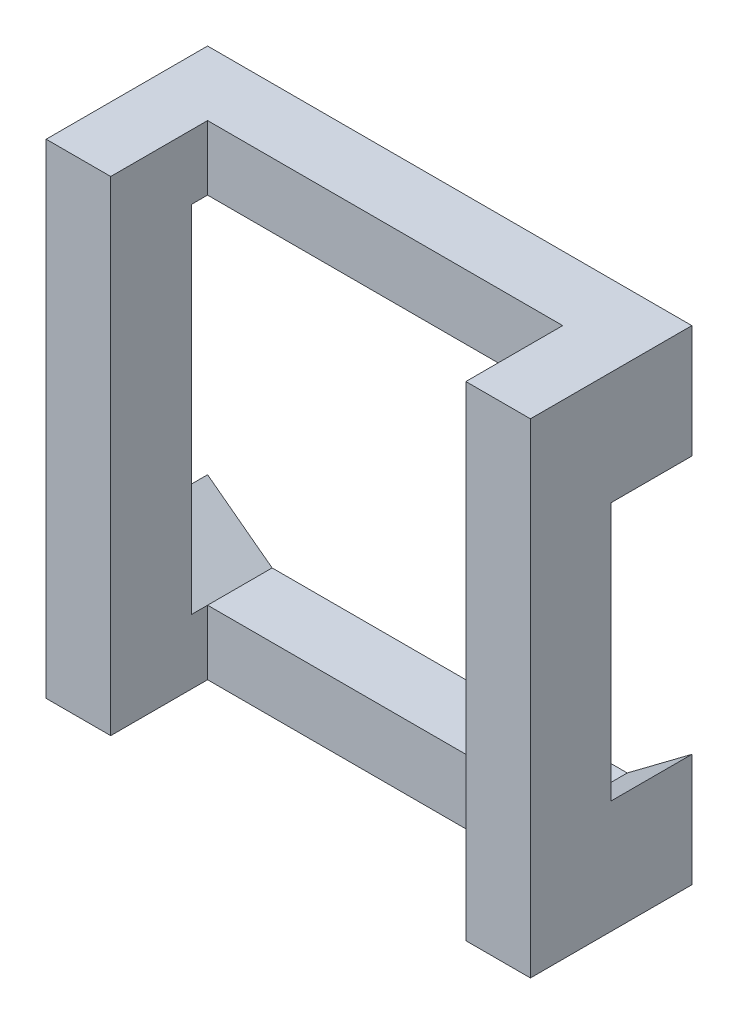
from build123d import *

# Parameters (mm, degrees)
SKETCH1_W           = 6
SKETCH1_H           = 6
BOSS_EXTRUDE1_DEPTH = 2
CUT_EXTRUDE1_DEPTH  = 1
SKETCH3_W           = 4.4
SKETCH3_H           = 4.4
CUT_EXTRUDE2_DEPTH  = 1
SKETCH4_W           = 4.4
SKETCH4_H           = 1.2
CUT_EXTRUDE3_DEPTH  = 9.717797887


with BuildPart() as part:
    # Sketch1 → Boss-Extrude1 (new body)
    with BuildSketch(Plane.XY):
        with Locations((3, 3)):
            Rectangle(SKETCH1_W, SKETCH1_H)
    extrude(amount=BOSS_EXTRUDE1_DEPTH)

    # Sketch2 → Cut-Extrude1 (cut)
    with BuildSketch(Plane(origin=(0, 0, 0), x_dir=(-1, 0, 0), z_dir=(0, 0, -1))):
        Polygon((-5.2, 5.2), (-0.8, 5.2), (0, 4.6), (0, 1.4), (-0.8, 0.8), (-5.2, 0.8), (-6, 1.4), (-6, 4.6), align=None)
    extrude(amount=-CUT_EXTRUDE1_DEPTH, mode=Mode.SUBTRACT)

    # Sketch3 → Cut-Extrude2 (cut)
    with BuildSketch(Plane(origin=(0, 0, 1), x_dir=(-1, 0, 0), z_dir=(0, 0, -1))):
        with Locations((-3, 3)):
            Rectangle(SKETCH3_W, SKETCH3_H)
    extrude(amount=-CUT_EXTRUDE2_DEPTH, mode=Mode.SUBTRACT)

    # Sketch4 → Cut-Extrude3 (cut, through all)
    with BuildSketch(Plane.XZ):
        with Locations((3, 1.4)):
            Rectangle(SKETCH4_W, SKETCH4_H)
    extrude(amount=-CUT_EXTRUDE3_DEPTH, mode=Mode.SUBTRACT)


solid = part.part
